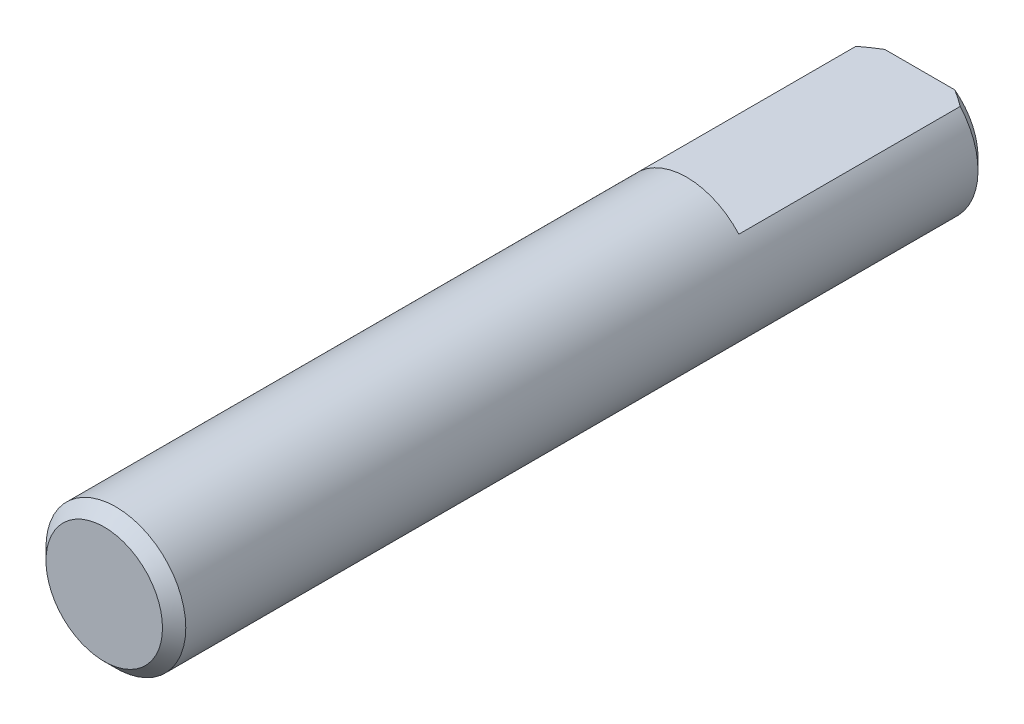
ISO-10303-21;
HEADER;
FILE_DESCRIPTION(('STEP AP214'),'2;1');
FILE_NAME('part.step','',(''),(''),'','','');
FILE_SCHEMA(('AUTOMOTIVE_DESIGN { 1 0 10303 214 1 1 1 1 }'));
ENDSEC;
DATA;
#1=APPLICATION_CONTEXT('core data for automotive mechanical design processes');
#2=APPLICATION_PROTOCOL_DEFINITION('international standard','automotive_design',2000,#1);
#3=PRODUCT_CONTEXT('',#1,'mechanical');
#4=PRODUCT('Part','Part','',(#3));
#5=PRODUCT_RELATED_PRODUCT_CATEGORY('part','',(#4));
#6=PRODUCT_DEFINITION_FORMATION('','',#4);
#7=PRODUCT_DEFINITION_CONTEXT('part definition',#1,'design');
#8=PRODUCT_DEFINITION('design','',#6,#7);
#9=PRODUCT_DEFINITION_SHAPE('','',#8);
#10=(LENGTH_UNIT() NAMED_UNIT(*) SI_UNIT(.MILLI.,.METRE.));
#11=(NAMED_UNIT(*) PLANE_ANGLE_UNIT() SI_UNIT($,.RADIAN.));
#12=(NAMED_UNIT(*) SI_UNIT($,.STERADIAN.) SOLID_ANGLE_UNIT());
#13=UNCERTAINTY_MEASURE_WITH_UNIT(LENGTH_MEASURE(1.E-05),#10,'distance_accuracy_value','');
#14=(GEOMETRIC_REPRESENTATION_CONTEXT(3) GLOBAL_UNCERTAINTY_ASSIGNED_CONTEXT((#13)) GLOBAL_UNIT_ASSIGNED_CONTEXT((#10,
#11,#12)) REPRESENTATION_CONTEXT('',''));
#15=CARTESIAN_POINT('',(0.,0.,0.));
#16=DIRECTION('',(0.,0.,1.));
#17=DIRECTION('',(1.,0.,0.));
#18=AXIS2_PLACEMENT_3D('',#15,#16,#17);
#19=CARTESIAN_POINT('',(0.,0.,35.));
#20=DIRECTION('',(0.,0.,-1.));
#21=DIRECTION('',(-1.,0.,0.));
#22=AXIS2_PLACEMENT_3D('',#19,#20,#21);
#23=CYLINDRICAL_SURFACE('',#22,2.99999999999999);
#24=CARTESIAN_POINT('',(0.,0.,34.5));
#25=DIRECTION('',(0.,0.,1.));
#26=DIRECTION('',(1.,0.,0.));
#27=AXIS2_PLACEMENT_3D('',#24,#25,#26);
#28=CIRCLE('',#27,2.99999999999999);
#29=CARTESIAN_POINT('',(2.99999999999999,0.,34.5));
#30=VERTEX_POINT('',#29);
#31=EDGE_CURVE('E83',#30,#30,#28,.F.);
#32=ORIENTED_EDGE('',*,*,#31,.T.);
#33=EDGE_LOOP('',(#32));
#34=FACE_BOUND('',#33,.T.);
#35=DIRECTION('',(0.,0.,-1.));
#36=VECTOR('',#35,1.);
#37=CARTESIAN_POINT('',(-2.23606797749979,2.,10.));
#38=LINE('',#37,#36);
#39=CARTESIAN_POINT('',(-2.23606797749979,2.,10.));
#40=VERTEX_POINT('',#39);
#41=CARTESIAN_POINT('',(-2.23606797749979,2.,0.500000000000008));
#42=VERTEX_POINT('',#41);
#43=EDGE_CURVE('E71',#40,#42,#38,.T.);
#44=ORIENTED_EDGE('',*,*,#43,.T.);
#45=CARTESIAN_POINT('',(0.,0.,0.500000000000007));
#46=DIRECTION('',(0.,0.,1.));
#47=DIRECTION('',(1.,0.,0.));
#48=AXIS2_PLACEMENT_3D('',#45,#46,#47);
#49=CIRCLE('',#48,2.99999999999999);
#50=CARTESIAN_POINT('',(2.23606797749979,2.,0.500000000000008));
#51=VERTEX_POINT('',#50);
#52=EDGE_CURVE('E75',#42,#51,#49,.T.);
#53=ORIENTED_EDGE('',*,*,#52,.T.);
#54=DIRECTION('',(0.,0.,-1.));
#55=VECTOR('',#54,1.);
#56=CARTESIAN_POINT('',(2.23606797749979,2.,10.));
#57=LINE('',#56,#55);
#58=CARTESIAN_POINT('',(2.23606797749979,2.,10.));
#59=VERTEX_POINT('',#58);
#60=EDGE_CURVE('E70',#59,#51,#57,.T.);
#61=ORIENTED_EDGE('',*,*,#60,.F.);
#62=CARTESIAN_POINT('',(0.,0.,10.));
#63=DIRECTION('',(0.,0.,-1.));
#64=DIRECTION('',(-1.,0.,0.));
#65=AXIS2_PLACEMENT_3D('',#62,#63,#64);
#66=CIRCLE('',#65,2.99999999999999);
#67=EDGE_CURVE('E60',#40,#59,#66,.T.);
#68=ORIENTED_EDGE('',*,*,#67,.F.);
#69=EDGE_LOOP('',(#44,#53,#61,#68));
#70=FACE_BOUND('',#69,.T.);
#71=ADVANCED_FACE('F29',(#34,#70),#23,.T.);
#72=CARTESIAN_POINT('',(0.,0.,35.));
#73=DIRECTION('',(0.,0.,1.));
#74=DIRECTION('',(1.,0.,0.));
#75=AXIS2_PLACEMENT_3D('',#72,#73,#74);
#76=PLANE('',#75);
#77=CARTESIAN_POINT('',(0.,0.,35.));
#78=DIRECTION('',(0.,0.,1.));
#79=DIRECTION('',(1.,0.,0.));
#80=AXIS2_PLACEMENT_3D('',#77,#78,#79);
#81=CIRCLE('',#80,2.49999999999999);
#82=CARTESIAN_POINT('',(2.49999999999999,0.,35.));
#83=VERTEX_POINT('',#82);
#84=EDGE_CURVE('E77',#83,#83,#81,.T.);
#85=ORIENTED_EDGE('',*,*,#84,.T.);
#86=EDGE_LOOP('',(#85));
#87=FACE_BOUND('',#86,.T.);
#88=ADVANCED_FACE('F105',(#87),#76,.T.);
#89=CARTESIAN_POINT('',(0.,0.,0.));
#90=DIRECTION('',(0.,0.,1.));
#91=DIRECTION('',(1.,0.,0.));
#92=AXIS2_PLACEMENT_3D('',#89,#90,#91);
#93=PLANE('',#92);
#94=DIRECTION('',(-1.,0.,0.));
#95=VECTOR('',#94,1.);
#96=CARTESIAN_POINT('',(2.23606797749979,2.,0.));
#97=LINE('',#96,#95);
#98=CARTESIAN_POINT('',(1.49999999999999,2.,0.));
#99=VERTEX_POINT('',#98);
#100=CARTESIAN_POINT('',(-1.49999999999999,2.,0.));
#101=VERTEX_POINT('',#100);
#102=EDGE_CURVE('E67',#99,#101,#97,.T.);
#103=ORIENTED_EDGE('',*,*,#102,.F.);
#104=CARTESIAN_POINT('',(0.,0.,0.));
#105=DIRECTION('',(0.,0.,1.));
#106=DIRECTION('',(1.,0.,0.));
#107=AXIS2_PLACEMENT_3D('',#104,#105,#106);
#108=CIRCLE('',#107,2.49999999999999);
#109=EDGE_CURVE('E11',#99,#101,#108,.F.);
#110=ORIENTED_EDGE('',*,*,#109,.T.);
#111=EDGE_LOOP('',(#103,#110));
#112=FACE_BOUND('',#111,.T.);
#113=ADVANCED_FACE('F102',(#112),#93,.F.);
#114=CARTESIAN_POINT('',(2.23606797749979,2.,10.));
#115=DIRECTION('',(0.,-1.,0.));
#116=DIRECTION('',(0.,0.,-1.));
#117=AXIS2_PLACEMENT_3D('',#114,#115,#116);
#118=PLANE('',#117);
#119=ORIENTED_EDGE('',*,*,#60,.T.);
#120=CARTESIAN_POINT('',(2.23606797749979,2.,0.500000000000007));
#121=CARTESIAN_POINT('',(2.17657340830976,2.,0.455667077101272));
#122=CARTESIAN_POINT('',(2.11670900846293,2.,0.41182177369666));
#123=CARTESIAN_POINT('',(1.99613946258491,2.,0.325383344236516));
#124=CARTESIAN_POINT('',(1.93543485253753,2.,0.282789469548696));
#125=CARTESIAN_POINT('',(1.81300116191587,2.,0.199069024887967));
#126=CARTESIAN_POINT('',(1.75127191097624,2.,0.157942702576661));
#127=CARTESIAN_POINT('',(1.62658889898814,2.,0.0775079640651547));
#128=CARTESIAN_POINT('',(1.56363441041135,2.,0.0382006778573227));
#129=CARTESIAN_POINT('',(1.49999999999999,2.,0.));
#130=B_SPLINE_CURVE_WITH_KNOTS('',3,(#120,#121,#122,#123,#124,#125,#126,#127,#128,#129),
.UNSPECIFIED.,.F.,.F.,(4,2,2,2,4),(0.,0.222592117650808,0.445048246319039,0.667541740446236,
0.890171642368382),.UNSPECIFIED.);
#131=EDGE_CURVE('E36',#51,#99,#130,.T.);
#132=ORIENTED_EDGE('',*,*,#131,.T.);
#133=ORIENTED_EDGE('',*,*,#102,.T.);
#134=CARTESIAN_POINT('',(-1.49999999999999,2.,0.));
#135=CARTESIAN_POINT('',(-1.56363441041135,2.,0.0382006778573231));
#136=CARTESIAN_POINT('',(-1.62658889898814,2.,0.0775079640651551));
#137=CARTESIAN_POINT('',(-1.75127191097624,2.,0.157942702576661));
#138=CARTESIAN_POINT('',(-1.81300116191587,2.,0.199069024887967));
#139=CARTESIAN_POINT('',(-1.93543485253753,2.,0.282789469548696));
#140=CARTESIAN_POINT('',(-1.99613946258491,2.,0.325383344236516));
#141=CARTESIAN_POINT('',(-2.11670900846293,2.,0.41182177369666));
#142=CARTESIAN_POINT('',(-2.17657340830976,2.,0.455667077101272));
#143=CARTESIAN_POINT('',(-2.23606797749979,2.,0.500000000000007));
#144=B_SPLINE_CURVE_WITH_KNOTS('',3,(#134,#135,#136,#137,#138,#139,#140,#141,#142,#143),
.UNSPECIFIED.,.F.,.F.,(4,2,2,2,4),(0.,0.222629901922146,0.445123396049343,0.667579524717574,
0.890171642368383),.UNSPECIFIED.);
#145=EDGE_CURVE('E86',#101,#42,#144,.T.);
#146=ORIENTED_EDGE('',*,*,#145,.T.);
#147=ORIENTED_EDGE('',*,*,#43,.F.);
#148=DIRECTION('',(-1.,0.,0.));
#149=VECTOR('',#148,1.);
#150=CARTESIAN_POINT('',(2.23606797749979,2.,10.));
#151=LINE('',#150,#149);
#152=EDGE_CURVE('E63',#59,#40,#151,.T.);
#153=ORIENTED_EDGE('',*,*,#152,.F.);
#154=EDGE_LOOP('',(#119,#132,#133,#146,#147,#153));
#155=FACE_BOUND('',#154,.T.);
#156=ADVANCED_FACE('F69',(#155),#118,.F.);
#157=CARTESIAN_POINT('',(0.,0.,10.));
#158=DIRECTION('',(0.,0.,-1.));
#159=DIRECTION('',(-1.,0.,0.));
#160=AXIS2_PLACEMENT_3D('',#157,#158,#159);
#161=PLANE('',#160);
#162=ORIENTED_EDGE('',*,*,#67,.T.);
#163=ORIENTED_EDGE('',*,*,#152,.T.);
#164=EDGE_LOOP('',(#162,#163));
#165=FACE_BOUND('',#164,.T.);
#166=ADVANCED_FACE('F62',(#165),#161,.T.);
#167=CARTESIAN_POINT('',(0.,0.,35.));
#168=DIRECTION('',(0.,0.,-1.));
#169=DIRECTION('',(-1.,0.,0.));
#170=AXIS2_PLACEMENT_3D('',#167,#168,#169);
#171=CONICAL_SURFACE('',#170,2.49999999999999,0.785398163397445);
#172=ORIENTED_EDGE('',*,*,#31,.F.);
#173=EDGE_LOOP('',(#172));
#174=FACE_BOUND('',#173,.T.);
#175=ORIENTED_EDGE('',*,*,#84,.F.);
#176=EDGE_LOOP('',(#175));
#177=FACE_BOUND('',#176,.T.);
#178=ADVANCED_FACE('F115',(#174,#177),#171,.T.);
#179=CARTESIAN_POINT('',(0.,0.,0.500000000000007));
#180=DIRECTION('',(0.,0.,1.));
#181=DIRECTION('',(1.,0.,0.));
#182=AXIS2_PLACEMENT_3D('',#179,#180,#181);
#183=CONICAL_SURFACE('',#182,2.99999999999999,0.785398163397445);
#184=ORIENTED_EDGE('',*,*,#145,.F.);
#185=ORIENTED_EDGE('',*,*,#109,.F.);
#186=ORIENTED_EDGE('',*,*,#131,.F.);
#187=ORIENTED_EDGE('',*,*,#52,.F.);
#188=EDGE_LOOP('',(#184,#185,#186,#187));
#189=FACE_BOUND('',#188,.T.);
#190=ADVANCED_FACE('F95',(#189),#183,.T.);
#191=CLOSED_SHELL('',(#71,#88,#113,#156,#166,#178,#190));
#192=MANIFOLD_SOLID_BREP('B2',#191);
#193=ADVANCED_BREP_SHAPE_REPRESENTATION('',(#18,#192),#14);
#194=SHAPE_DEFINITION_REPRESENTATION(#9,#193);
ENDSEC;
END-ISO-10303-21;
